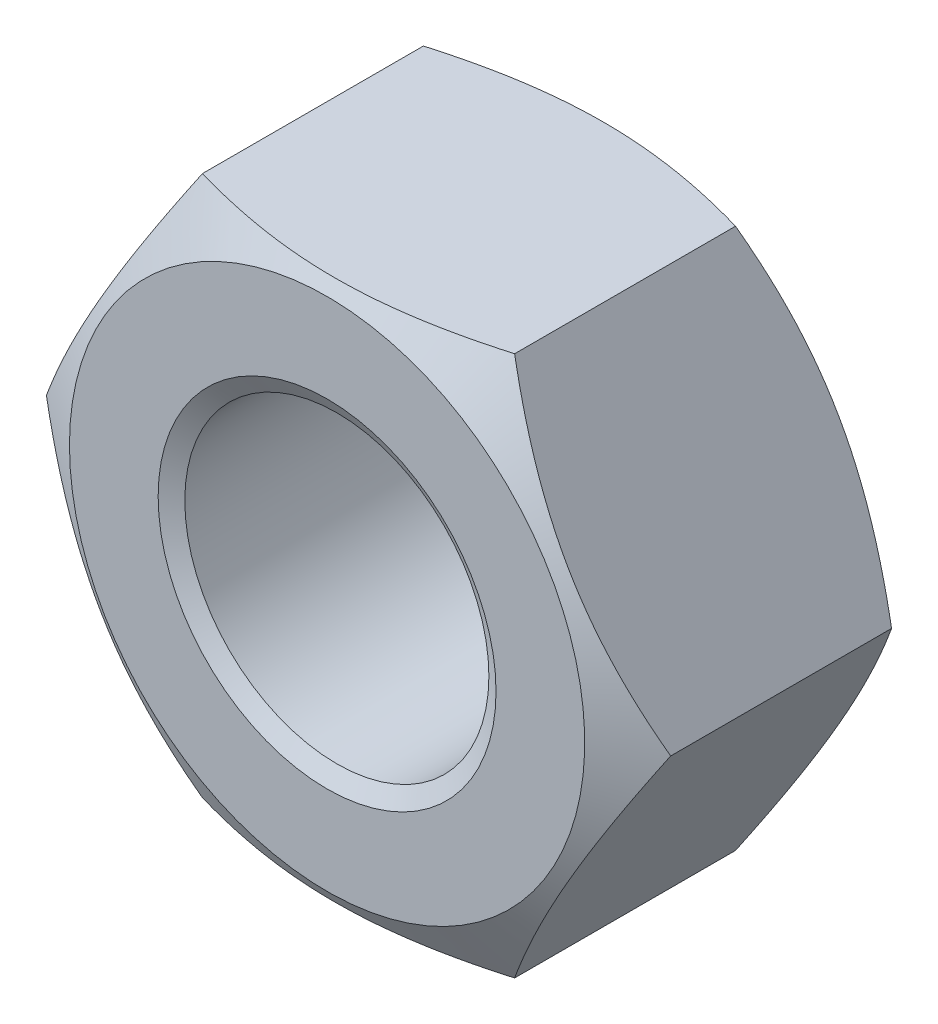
from build123d import *
from OCP.BRepFilletAPI import BRepFilletAPI_MakeChamfer

# Parameters (mm, degrees)
SKETCH1_R        = 4.5
BASENUT_DEPTH    = 8.4
ENDCHAMFER_SIZE  = 0.5
ENDCHAMFER_SIZE2 = 0.288675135


with BuildPart() as part:
    # Sketch1 → BaseNut (new body)
    with BuildSketch(Plane.XY):
        Polygon((9.237604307, 0), (4.618802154, 8), (-4.618802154, 8), (-9.237604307, 0), (-4.618802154, -8), (4.618802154, -8), align=None)
        Circle(SKETCH1_R, mode=Mode.SUBTRACT)
    extrude(amount=-BASENUT_DEPTH)

    # Sketch2 → Double-Chamfer (revolve, cut)
    with BuildSketch(Plane(origin=(0, 0, 0), x_dir=(1, 0, 0), z_dir=(0, 1, 0))):
        Polygon((-9.237604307, 8.4), (-7.625, 8.4), (-9.237604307, 7.468962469), align=None)
        Polygon((-9.237604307, 0.931037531), (-9.237604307, 0), (-7.625, 0), align=None)
    revolve(axis=Axis((0, 0, -3.375940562), (0, 0, 1)), mode=Mode.SUBTRACT)

    # EndChamfer: one chamfer whose edges measure the first distance from different faces: ONE call of the kernel's chamfer builder (chamfer() names one face for all edges)
    endchamfer_edges_1 = [part.edges().sort_by_distance(p)[0] for p in [
        (-4.5, 0, -8.4),
    ]]
    endchamfer_side_1 = [part.faces().sort_by_distance(p)[0] for p in [
        (-4.5, 0, -4.2),
    ]]
    endchamfer_edges_2 = [part.edges().sort_by_distance(p)[0] for p in [
        (-4.5, 0, 0),
    ]]
    endchamfer_side_2 = [part.faces().sort_by_distance(p)[0] for p in [
        (7.409332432, 0, 0),
    ]]
    endchamfer = BRepFilletAPI_MakeChamfer(part.part.solid().wrapped)
    for e in endchamfer_edges_1:
        endchamfer.Add(ENDCHAMFER_SIZE, ENDCHAMFER_SIZE2, e.wrapped, endchamfer_side_1[0].wrapped)  # the first distance lies on this face
    for e in endchamfer_edges_2:
        endchamfer.Add(ENDCHAMFER_SIZE, ENDCHAMFER_SIZE2, e.wrapped, endchamfer_side_2[0].wrapped)  # the first distance lies on this face
    add(Compound.cast(endchamfer.Shape()), mode=Mode.REPLACE)


solid = part.part
